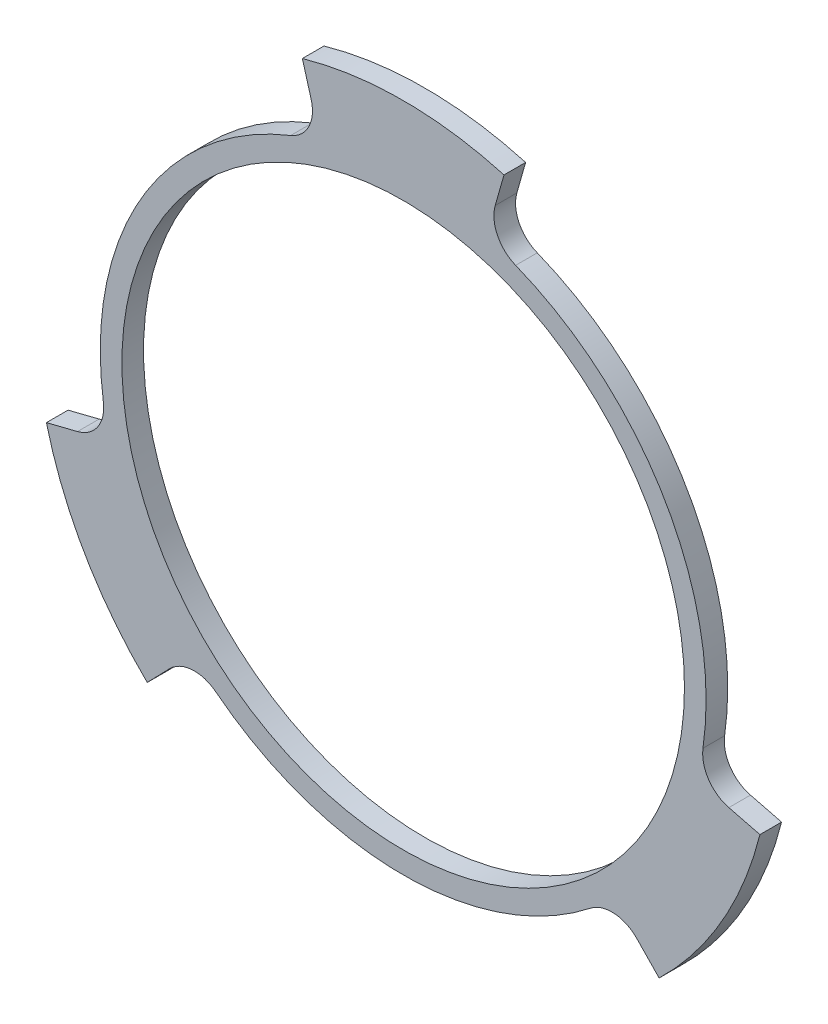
from build123d import *

# Parameters (mm, degrees)
SKETCH1_R      = 20.6375
EXTRUDE1_DEPTH = 1.5875
FILLET1_R      = 2.54


with BuildPart() as part:
    # Sketch1 → Extrude1 (new body)
    with BuildSketch(Plane.XY):
        with BuildLine():
            ThreePointArc((15.464443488, -15.962506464), (0, -22.225), (-15.464443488, -15.962506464))
            Line((-15.464443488, -15.962506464), (-18.778252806, -19.383043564))
            ThreePointArc((-18.778252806, -19.383043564), (-23.371860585, -13.49375), (-26.175334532, -6.570922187))
            Line((-26.175334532, -6.570922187), (-21.55615785, -5.411347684))
            ThreePointArc((-21.55615785, -5.411347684), (-19.247414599, 11.1125), (-6.091714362, 21.373854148))
            Line((-6.091714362, 21.373854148), (-7.397081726, 25.953965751))
            ThreePointArc((-7.397081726, 25.953965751), (0, 26.9875), (7.397081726, 25.953965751))
            Line((7.397081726, 25.953965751), (6.091714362, 21.373854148))
            ThreePointArc((6.091714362, 21.373854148), (19.247414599, 11.1125), (21.55615785, -5.411347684))
            Line((21.55615785, -5.411347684), (26.175334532, -6.570922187))
            ThreePointArc((26.175334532, -6.570922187), (23.371860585, -13.49375), (18.778252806, -19.383043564))
            Line((18.778252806, -19.383043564), (15.464443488, -15.962506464))
        make_face()
        Circle(SKETCH1_R, mode=Mode.SUBTRACT)
    extrude(amount=EXTRUDE1_DEPTH)

    # Fillet1
    fillet1_edges = [part.edges().sort_by_distance(p)[0] for p in [
        (-15.464443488, -15.962506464, 0.79375),
        (-21.55615785, -5.411347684, 0.79375),
        (-6.091714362, 21.373854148, 0.79375),
        (6.091714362, 21.373854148, 0.79375),
        (21.55615785, -5.411347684, 0.79375),
        (15.464443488, -15.962506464, 0.79375),
    ]]
    fillet(fillet1_edges, radius=FILLET1_R)


solid = part.part
